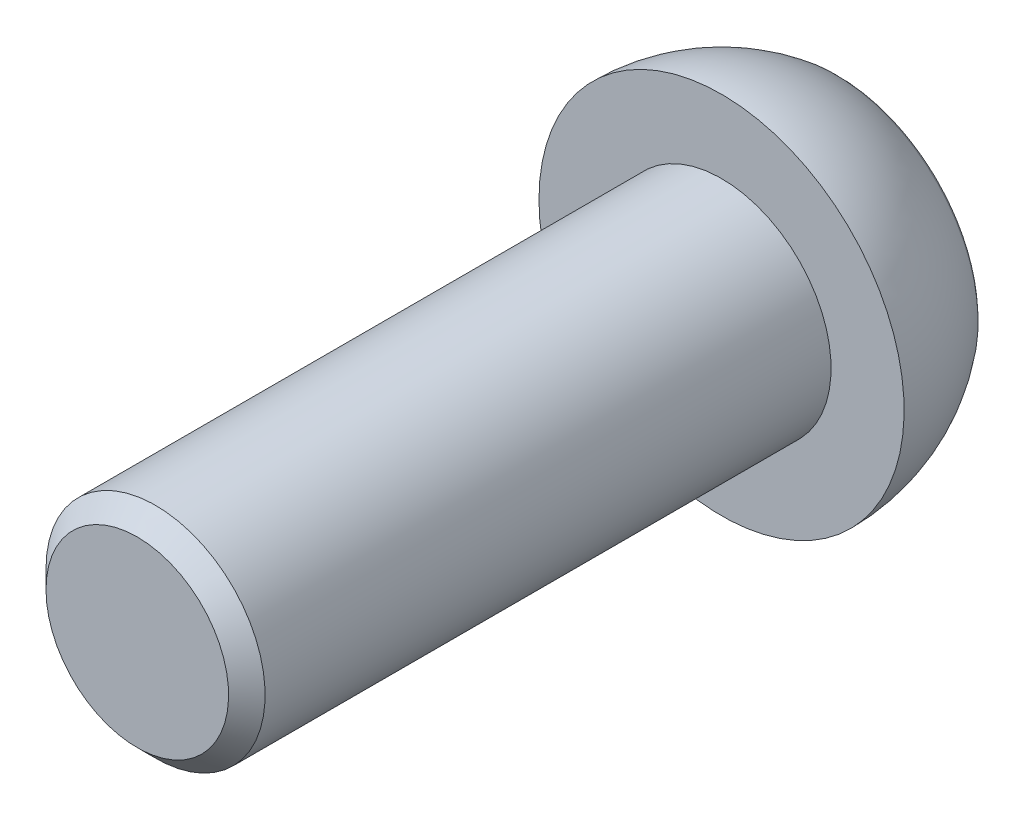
ISO-10303-21;
HEADER;
FILE_DESCRIPTION(('STEP AP214'),'2;1');
FILE_NAME('part.step','',(''),(''),'','','');
FILE_SCHEMA(('AUTOMOTIVE_DESIGN { 1 0 10303 214 1 1 1 1 }'));
ENDSEC;
DATA;
#1=APPLICATION_CONTEXT('core data for automotive mechanical design processes');
#2=APPLICATION_PROTOCOL_DEFINITION('international standard','automotive_design',2000,#1);
#3=PRODUCT_CONTEXT('',#1,'mechanical');
#4=PRODUCT('Part','Part','',(#3));
#5=PRODUCT_RELATED_PRODUCT_CATEGORY('part','',(#4));
#6=PRODUCT_DEFINITION_FORMATION('','',#4);
#7=PRODUCT_DEFINITION_CONTEXT('part definition',#1,'design');
#8=PRODUCT_DEFINITION('design','',#6,#7);
#9=PRODUCT_DEFINITION_SHAPE('','',#8);
#10=(LENGTH_UNIT() NAMED_UNIT(*) SI_UNIT(.MILLI.,.METRE.));
#11=(NAMED_UNIT(*) PLANE_ANGLE_UNIT() SI_UNIT($,.RADIAN.));
#12=(NAMED_UNIT(*) SI_UNIT($,.STERADIAN.) SOLID_ANGLE_UNIT());
#13=UNCERTAINTY_MEASURE_WITH_UNIT(LENGTH_MEASURE(1.E-05),#10,'distance_accuracy_value','');
#14=(GEOMETRIC_REPRESENTATION_CONTEXT(3) GLOBAL_UNCERTAINTY_ASSIGNED_CONTEXT((#13)) GLOBAL_UNIT_ASSIGNED_CONTEXT((#10,
#11,#12)) REPRESENTATION_CONTEXT('',''));
#15=CARTESIAN_POINT('',(0.,0.,0.));
#16=DIRECTION('',(0.,0.,1.));
#17=DIRECTION('',(1.,0.,0.));
#18=AXIS2_PLACEMENT_3D('',#15,#16,#17);
#19=CARTESIAN_POINT('',(-62.1361919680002,258.189999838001,-24.0000000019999));
#20=DIRECTION('',(0.,0.,-0.999999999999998));
#21=DIRECTION('',(0.99035023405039,0.138587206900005,0.));
#22=AXIS2_PLACEMENT_3D('',#19,#20,#21);
#23=PLANE('',#22);
#24=DIRECTION('',(0.3751550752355,0.926962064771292,0.));
#25=VECTOR('',#24,1.);
#26=CARTESIAN_POINT('',(-61.2958197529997,257.113059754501,-24.0000000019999));
#27=LINE('',#26,#25);
#28=CARTESIAN_POINT('',(-61.8082911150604,255.846806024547,-24.0000000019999));
#29=VERTEX_POINT('',#28);
#30=CARTESIAN_POINT('',(-60.7833483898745,258.379313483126,-24.0000000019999));
#31=VERTEX_POINT('',#30);
#32=EDGE_CURVE('E123',#29,#31,#27,.T.);
#33=ORIENTED_EDGE('',*,*,#32,.T.);
#34=DIRECTION('',(0.990350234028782,0.13858720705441,0.));
#35=VECTOR('',#34,1.);
#36=CARTESIAN_POINT('',(-59.4305048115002,258.568627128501,-24.0000000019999));
#37=LINE('',#36,#35);
#38=CARTESIAN_POINT('',(-58.0776612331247,258.757940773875,-24.0000000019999));
#39=VERTEX_POINT('',#38);
#40=EDGE_CURVE('E103',#31,#39,#37,.T.);
#41=ORIENTED_EDGE('',*,*,#40,.T.);
#42=DIRECTION('',(0.615195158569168,-0.788374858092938,0.));
#43=VECTOR('',#42,1.);
#44=CARTESIAN_POINT('',(-57.2372890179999,257.681000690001,-24.0000000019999));
#45=LINE('',#44,#43);
#46=CARTESIAN_POINT('',(-56.3969168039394,256.604060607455,-24.0000000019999));
#47=VERTEX_POINT('',#46);
#48=EDGE_CURVE('E99',#39,#47,#45,.T.);
#49=ORIENTED_EDGE('',*,*,#48,.T.);
#50=DIRECTION('',(-0.375155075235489,-0.926962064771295,0.));
#51=VECTOR('',#50,1.);
#52=CARTESIAN_POINT('',(-56.9093881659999,255.337806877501,-24.0000000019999));
#53=LINE('',#52,#51);
#54=CARTESIAN_POINT('',(-57.4218595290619,254.071553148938,-24.0000000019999));
#55=VERTEX_POINT('',#54);
#56=EDGE_CURVE('E101',#47,#55,#53,.T.);
#57=ORIENTED_EDGE('',*,*,#56,.T.);
#58=DIRECTION('',(-0.990350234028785,-0.13858720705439,0.));
#59=VECTOR('',#58,1.);
#60=CARTESIAN_POINT('',(-58.7747031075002,253.882239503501,-24.0000000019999));
#61=LINE('',#60,#59);
#62=CARTESIAN_POINT('',(-60.1275466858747,253.692925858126,-24.0000000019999));
#63=VERTEX_POINT('',#62);
#64=EDGE_CURVE('E85',#55,#63,#61,.T.);
#65=ORIENTED_EDGE('',*,*,#64,.T.);
#66=DIRECTION('',(-0.615195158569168,0.788374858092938,0.));
#67=VECTOR('',#66,1.);
#68=CARTESIAN_POINT('',(-60.9679189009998,254.769865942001,-24.0000000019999));
#69=LINE('',#68,#67);
#70=EDGE_CURVE('E130',#63,#29,#69,.T.);
#71=ORIENTED_EDGE('',*,*,#70,.T.);
#72=EDGE_LOOP('',(#33,#41,#49,#57,#65,#71));
#73=FACE_BOUND('',#72,.T.);
#74=ADVANCED_FACE('F30',(#73),#23,.T.);
#75=CARTESIAN_POINT('',(-59.1026039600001,256.225433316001,-8.000000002));
#76=DIRECTION('',(0.,0.,-0.999999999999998));
#77=DIRECTION('',(-1.,0.,0.));
#78=AXIS2_PLACEMENT_3D('',#75,#76,#77);
#79=CYLINDRICAL_SURFACE('',#78,3.00000000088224);
#80=CARTESIAN_POINT('',(-59.1026039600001,256.225433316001,-7.50000000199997));
#81=DIRECTION('',(0.,0.,-1.));
#82=DIRECTION('',(-1.,0.,0.));
#83=AXIS2_PLACEMENT_3D('',#80,#81,#82);
#84=CIRCLE('',#83,3.00000000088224);
#85=CARTESIAN_POINT('',(-62.1026039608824,256.225433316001,-7.50000000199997));
#86=VERTEX_POINT('',#85);
#87=EDGE_CURVE('E11',#86,#86,#84,.T.);
#88=CARTESIAN_POINT('',(-59.1026039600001,256.225433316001,-23.000000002));
#89=DIRECTION('',(0.,0.,-0.999999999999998));
#90=DIRECTION('',(-1.,0.,0.));
#91=AXIS2_PLACEMENT_3D('',#88,#89,#90);
#92=CIRCLE('',#91,3.00000000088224);
#93=CARTESIAN_POINT('',(-62.1026039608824,256.225433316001,-23.000000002));
#94=VERTEX_POINT('',#93);
#95=EDGE_CURVE('E144',#94,#94,#92,.F.);
#96=CARTESIAN_POINT('',(-62.1026039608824,256.225433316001,-7.50000000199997));
#97=CARTESIAN_POINT('',(-62.1026039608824,256.225433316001,-7.6614583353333));
#98=CARTESIAN_POINT('',(-62.1026039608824,256.225433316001,-7.82291666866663));
#99=CARTESIAN_POINT('',(-62.1026039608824,256.225433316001,-8.1458333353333));
#100=CARTESIAN_POINT('',(-62.1026039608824,256.225433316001,-8.30729166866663));
#101=CARTESIAN_POINT('',(-62.1026039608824,256.225433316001,-8.6302083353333));
#102=CARTESIAN_POINT('',(-62.1026039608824,256.225433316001,-8.79166666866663));
#103=CARTESIAN_POINT('',(-62.1026039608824,256.225433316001,-9.1145833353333));
#104=CARTESIAN_POINT('',(-62.1026039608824,256.225433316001,-9.27604166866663));
#105=CARTESIAN_POINT('',(-62.1026039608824,256.225433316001,-9.5989583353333));
#106=CARTESIAN_POINT('',(-62.1026039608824,256.225433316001,-9.76041666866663));
#107=CARTESIAN_POINT('',(-62.1026039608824,256.225433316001,-10.0833333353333));
#108=CARTESIAN_POINT('',(-62.1026039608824,256.225433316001,-10.2447916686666));
#109=CARTESIAN_POINT('',(-62.1026039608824,256.225433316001,-10.5677083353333));
#110=CARTESIAN_POINT('',(-62.1026039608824,256.225433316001,-10.7291666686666));
#111=CARTESIAN_POINT('',(-62.1026039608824,256.225433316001,-11.0520833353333));
#112=CARTESIAN_POINT('',(-62.1026039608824,256.225433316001,-11.2135416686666));
#113=CARTESIAN_POINT('',(-62.1026039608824,256.225433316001,-11.5364583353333));
#114=CARTESIAN_POINT('',(-62.1026039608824,256.225433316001,-11.6979166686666));
#115=CARTESIAN_POINT('',(-62.1026039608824,256.225433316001,-12.0208333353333));
#116=CARTESIAN_POINT('',(-62.1026039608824,256.225433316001,-12.1822916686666));
#117=CARTESIAN_POINT('',(-62.1026039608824,256.225433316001,-12.5052083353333));
#118=CARTESIAN_POINT('',(-62.1026039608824,256.225433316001,-12.6666666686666));
#119=CARTESIAN_POINT('',(-62.1026039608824,256.225433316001,-12.9895833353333));
#120=CARTESIAN_POINT('',(-62.1026039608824,256.225433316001,-13.1510416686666));
#121=CARTESIAN_POINT('',(-62.1026039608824,256.225433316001,-13.4739583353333));
#122=CARTESIAN_POINT('',(-62.1026039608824,256.225433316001,-13.6354166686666));
#123=CARTESIAN_POINT('',(-62.1026039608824,256.225433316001,-13.9583333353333));
#124=CARTESIAN_POINT('',(-62.1026039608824,256.225433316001,-14.1197916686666));
#125=CARTESIAN_POINT('',(-62.1026039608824,256.225433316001,-14.4427083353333));
#126=CARTESIAN_POINT('',(-62.1026039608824,256.225433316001,-14.6041666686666));
#127=CARTESIAN_POINT('',(-62.1026039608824,256.225433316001,-14.9270833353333));
#128=CARTESIAN_POINT('',(-62.1026039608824,256.225433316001,-15.0885416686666));
#129=CARTESIAN_POINT('',(-62.1026039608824,256.225433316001,-15.4114583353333));
#130=CARTESIAN_POINT('',(-62.1026039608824,256.225433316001,-15.5729166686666));
#131=CARTESIAN_POINT('',(-62.1026039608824,256.225433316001,-15.8958333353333));
#132=CARTESIAN_POINT('',(-62.1026039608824,256.225433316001,-16.0572916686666));
#133=CARTESIAN_POINT('',(-62.1026039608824,256.225433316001,-16.3802083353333));
#134=CARTESIAN_POINT('',(-62.1026039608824,256.225433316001,-16.5416666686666));
#135=CARTESIAN_POINT('',(-62.1026039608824,256.225433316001,-16.8645833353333));
#136=CARTESIAN_POINT('',(-62.1026039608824,256.225433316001,-17.0260416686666));
#137=CARTESIAN_POINT('',(-62.1026039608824,256.225433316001,-17.3489583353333));
#138=CARTESIAN_POINT('',(-62.1026039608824,256.225433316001,-17.5104166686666));
#139=CARTESIAN_POINT('',(-62.1026039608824,256.225433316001,-17.8333333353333));
#140=CARTESIAN_POINT('',(-62.1026039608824,256.225433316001,-17.9947916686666));
#141=CARTESIAN_POINT('',(-62.1026039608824,256.225433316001,-18.3177083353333));
#142=CARTESIAN_POINT('',(-62.1026039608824,256.225433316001,-18.4791666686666));
#143=CARTESIAN_POINT('',(-62.1026039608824,256.225433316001,-18.8020833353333));
#144=CARTESIAN_POINT('',(-62.1026039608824,256.225433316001,-18.9635416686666));
#145=CARTESIAN_POINT('',(-62.1026039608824,256.225433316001,-19.2864583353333));
#146=CARTESIAN_POINT('',(-62.1026039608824,256.225433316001,-19.4479166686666));
#147=CARTESIAN_POINT('',(-62.1026039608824,256.225433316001,-19.7708333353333));
#148=CARTESIAN_POINT('',(-62.1026039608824,256.225433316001,-19.9322916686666));
#149=CARTESIAN_POINT('',(-62.1026039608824,256.225433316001,-20.2552083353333));
#150=CARTESIAN_POINT('',(-62.1026039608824,256.225433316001,-20.4166666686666));
#151=CARTESIAN_POINT('',(-62.1026039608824,256.225433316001,-20.7395833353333));
#152=CARTESIAN_POINT('',(-62.1026039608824,256.225433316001,-20.9010416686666));
#153=CARTESIAN_POINT('',(-62.1026039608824,256.225433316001,-21.2239583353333));
#154=CARTESIAN_POINT('',(-62.1026039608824,256.225433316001,-21.3854166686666));
#155=CARTESIAN_POINT('',(-62.1026039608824,256.225433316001,-21.7083333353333));
#156=CARTESIAN_POINT('',(-62.1026039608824,256.225433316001,-21.8697916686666));
#157=CARTESIAN_POINT('',(-62.1026039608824,256.225433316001,-22.1927083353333));
#158=CARTESIAN_POINT('',(-62.1026039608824,256.225433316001,-22.3541666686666));
#159=CARTESIAN_POINT('',(-62.1026039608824,256.225433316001,-22.6770833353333));
#160=CARTESIAN_POINT('',(-62.1026039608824,256.225433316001,-22.8385416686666));
#161=CARTESIAN_POINT('',(-62.1026039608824,256.225433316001,-23.000000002));
#162=B_SPLINE_CURVE_WITH_KNOTS('',3,(#96,#97,#98,#99,#100,#101,#102,#103,#104,#105,#106,#107,
#108,#109,#110,#111,#112,#113,#114,#115,#116,#117,#118,#119,#120,#121,#122,#123,#124,#125,#126,
#127,#128,#129,#130,#131,#132,#133,#134,#135,#136,#137,#138,#139,#140,#141,#142,#143,#144,#145,
#146,#147,#148,#149,#150,#151,#152,#153,#154,#155,#156,#157,#158,#159,#160,#161),.UNSPECIFIED.,
.F.,.F.,(4,2,2,2,2,2,2,2,2,2,2,2,2,2,2,2,2,2,2,2,2,2,2,2,2,2,2,2,2,2,2,2,4),(0.,0.484375,
0.968749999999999,1.453125,1.9375,2.421875,2.90625,3.390625,3.875,4.359375,4.84375,5.328125,
5.81249999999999,6.29687499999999,6.78124999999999,7.26562499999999,7.74999999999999,
8.23437499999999,8.71874999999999,9.20312499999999,9.68749999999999,10.171875,10.65625,
11.140625,11.625,12.109375,12.59375,13.078125,13.5625,14.046875,14.53125,15.015625,15.5),.UNSPECIFIED.);
#163=EDGE_CURVE('BSEAM187',#86,#94,#162,.T.);
#164=ORIENTED_EDGE('',*,*,#87,.T.);
#165=ORIENTED_EDGE('',*,*,#95,.T.);
#166=ORIENTED_EDGE('',*,*,#163,.T.);
#167=ORIENTED_EDGE('',*,*,#163,.F.);
#168=EDGE_LOOP('',(#164,#166,#165,#167));
#169=FACE_BOUND('',#168,.T.);
#170=ADVANCED_FACE('F187',(#169),#79,.T.);
#171=CARTESIAN_POINT('',(-57.4218595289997,254.071553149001,-26.3000000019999));
#172=DIRECTION('',(0.926962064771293,-0.375155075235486,0.));
#173=DIRECTION('',(0.375155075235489,0.926962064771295,0.));
#174=AXIS2_PLACEMENT_3D('',#171,#172,#173);
#175=PLANE('',#174);
#176=DIRECTION('',(0.,0.,0.999999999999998));
#177=VECTOR('',#176,1.);
#178=CARTESIAN_POINT('',(-57.4218595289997,254.071553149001,-25.1500000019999));
#179=LINE('',#178,#177);
#180=CARTESIAN_POINT('',(-57.4218595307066,254.071553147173,-26.3000000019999));
#181=VERTEX_POINT('',#180);
#182=EDGE_CURVE('E111',#181,#55,#179,.T.);
#183=ORIENTED_EDGE('',*,*,#182,.T.);
#184=ORIENTED_EDGE('',*,*,#56,.F.);
#185=DIRECTION('',(0.,0.,-0.999999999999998));
#186=VECTOR('',#185,1.);
#187=CARTESIAN_POINT('',(-56.396916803,256.604060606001,-25.1500000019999));
#188=LINE('',#187,#186);
#189=CARTESIAN_POINT('',(-56.3969168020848,256.604060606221,-26.3000000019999));
#190=VERTEX_POINT('',#189);
#191=EDGE_CURVE('E107',#47,#190,#188,.T.);
#192=ORIENTED_EDGE('',*,*,#191,.T.);
#193=DIRECTION('',(0.37515507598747,0.926962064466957,0.));
#194=VECTOR('',#193,1.);
#195=CARTESIAN_POINT('',(-57.4218595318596,254.07155314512,-26.3000000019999));
#196=LINE('',#195,#194);
#197=EDGE_CURVE('E76',#181,#190,#196,.T.);
#198=ORIENTED_EDGE('',*,*,#197,.F.);
#199=EDGE_LOOP('',(#183,#184,#192,#198));
#200=FACE_BOUND('',#199,.T.);
#201=ADVANCED_FACE('F109',(#200),#175,.F.);
#202=CARTESIAN_POINT('',(-56.396916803,256.604060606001,-26.3000000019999));
#203=DIRECTION('',(0.788374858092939,0.615195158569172,0.));
#204=DIRECTION('',(-0.615195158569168,0.788374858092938,0.));
#205=AXIS2_PLACEMENT_3D('',#202,#203,#204);
#206=PLANE('',#205);
#207=ORIENTED_EDGE('',*,*,#191,.F.);
#208=ORIENTED_EDGE('',*,*,#48,.F.);
#209=DIRECTION('',(0.,0.,-0.999999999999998));
#210=VECTOR('',#209,1.);
#211=CARTESIAN_POINT('',(-58.0776612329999,258.757940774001,-25.1500000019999));
#212=LINE('',#211,#210);
#213=CARTESIAN_POINT('',(-58.077661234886,258.757940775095,-26.3000000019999));
#214=VERTEX_POINT('',#213);
#215=EDGE_CURVE('E117',#39,#214,#212,.T.);
#216=ORIENTED_EDGE('',*,*,#215,.T.);
#217=DIRECTION('',(-0.615195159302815,0.788374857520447,0.));
#218=VECTOR('',#217,1.);
#219=CARTESIAN_POINT('',(-56.3969168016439,256.604060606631,-26.3000000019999));
#220=LINE('',#219,#218);
#221=EDGE_CURVE('E115',#190,#214,#220,.T.);
#222=ORIENTED_EDGE('',*,*,#221,.F.);
#223=EDGE_LOOP('',(#207,#208,#216,#222));
#224=FACE_BOUND('',#223,.T.);
#225=ADVANCED_FACE('F113',(#224),#206,.F.);
#226=CARTESIAN_POINT('',(-58.0776612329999,258.757940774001,-24.0000000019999));
#227=DIRECTION('',(-0.138587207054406,0.990350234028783,0.));
#228=DIRECTION('',(0.,0.,-0.999999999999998));
#229=AXIS2_PLACEMENT_3D('',#226,#227,#228);
#230=PLANE('',#229);
#231=ORIENTED_EDGE('',*,*,#215,.F.);
#232=ORIENTED_EDGE('',*,*,#40,.F.);
#233=DIRECTION('',(0.,0.,-0.999999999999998));
#234=VECTOR('',#233,1.);
#235=CARTESIAN_POINT('',(-60.7833483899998,258.379313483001,-25.1500000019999));
#236=LINE('',#235,#234);
#237=CARTESIAN_POINT('',(-60.7833483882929,258.379313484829,-26.3000000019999));
#238=VERTEX_POINT('',#237);
#239=EDGE_CURVE('E128',#31,#238,#236,.T.);
#240=ORIENTED_EDGE('',*,*,#239,.T.);
#241=DIRECTION('',(-0.990350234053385,-0.138587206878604,0.));
#242=VECTOR('',#241,1.);
#243=CARTESIAN_POINT('',(-59.4305048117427,258.568627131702,-26.3000000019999));
#244=LINE('',#243,#242);
#245=EDGE_CURVE('E124',#214,#238,#244,.T.);
#246=ORIENTED_EDGE('',*,*,#245,.F.);
#247=EDGE_LOOP('',(#231,#232,#240,#246));
#248=FACE_BOUND('',#247,.T.);
#249=ADVANCED_FACE('F214',(#248),#230,.F.);
#250=CARTESIAN_POINT('',(-60.7833483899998,258.379313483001,-26.3000000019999));
#251=DIRECTION('',(-0.926962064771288,0.375155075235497,0.));
#252=DIRECTION('',(-0.3751550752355,-0.926962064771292,0.));
#253=AXIS2_PLACEMENT_3D('',#250,#251,#252);
#254=PLANE('',#253);
#255=ORIENTED_EDGE('',*,*,#239,.F.);
#256=ORIENTED_EDGE('',*,*,#32,.F.);
#257=DIRECTION('',(0.,0.,-0.999999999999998));
#258=VECTOR('',#257,1.);
#259=CARTESIAN_POINT('',(-61.8082911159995,255.846806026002,-25.1500000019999));
#260=LINE('',#259,#258);
#261=CARTESIAN_POINT('',(-61.8082911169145,255.846806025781,-26.3000000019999));
#262=VERTEX_POINT('',#261);
#263=EDGE_CURVE('E208',#29,#262,#260,.T.);
#264=ORIENTED_EDGE('',*,*,#263,.T.);
#265=DIRECTION('',(-0.375155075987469,-0.926962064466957,0.));
#266=VECTOR('',#265,1.);
#267=CARTESIAN_POINT('',(-60.7833483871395,258.379313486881,-26.3000000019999));
#268=LINE('',#267,#266);
#269=EDGE_CURVE('E127',#238,#262,#268,.T.);
#270=ORIENTED_EDGE('',*,*,#269,.F.);
#271=EDGE_LOOP('',(#255,#256,#264,#270));
#272=FACE_BOUND('',#271,.T.);
#273=ADVANCED_FACE('F217',(#272),#254,.F.);
#274=CARTESIAN_POINT('',(-61.8082911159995,255.846806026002,-26.3000000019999));
#275=DIRECTION('',(-0.788374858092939,-0.615195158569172,0.));
#276=DIRECTION('',(0.615195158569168,-0.788374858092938,0.));
#277=AXIS2_PLACEMENT_3D('',#274,#275,#276);
#278=PLANE('',#277);
#279=ORIENTED_EDGE('',*,*,#263,.F.);
#280=ORIENTED_EDGE('',*,*,#70,.F.);
#281=DIRECTION('',(0.,0.,-0.999999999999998));
#282=VECTOR('',#281,1.);
#283=CARTESIAN_POINT('',(-60.1275466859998,253.692925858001,-25.1500000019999));
#284=LINE('',#283,#282);
#285=CARTESIAN_POINT('',(-60.1275466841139,253.692925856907,-26.3000000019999));
#286=VERTEX_POINT('',#285);
#287=EDGE_CURVE('E206',#63,#286,#284,.T.);
#288=ORIENTED_EDGE('',*,*,#287,.T.);
#289=DIRECTION('',(0.615195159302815,-0.788374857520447,0.));
#290=VECTOR('',#289,1.);
#291=CARTESIAN_POINT('',(-61.8082911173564,255.84680602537,-26.3000000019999));
#292=LINE('',#291,#290);
#293=EDGE_CURVE('E135',#262,#286,#292,.T.);
#294=ORIENTED_EDGE('',*,*,#293,.F.);
#295=EDGE_LOOP('',(#279,#280,#288,#294));
#296=FACE_BOUND('',#295,.T.);
#297=ADVANCED_FACE('F289',(#296),#278,.F.);
#298=CARTESIAN_POINT('',(-57.4218595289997,254.071553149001,-26.3000000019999));
#299=DIRECTION('',(0.138587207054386,-0.990350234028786,0.));
#300=DIRECTION('',(0.,0.,0.999999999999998));
#301=AXIS2_PLACEMENT_3D('',#298,#299,#300);
#302=PLANE('',#301);
#303=ORIENTED_EDGE('',*,*,#287,.F.);
#304=ORIENTED_EDGE('',*,*,#64,.F.);
#305=ORIENTED_EDGE('',*,*,#182,.F.);
#306=DIRECTION('',(0.990350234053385,0.138587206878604,0.));
#307=VECTOR('',#306,1.);
#308=CARTESIAN_POINT('',(-58.7747031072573,253.8822395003,-26.3000000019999));
#309=LINE('',#308,#307);
#310=EDGE_CURVE('E138',#286,#181,#309,.T.);
#311=ORIENTED_EDGE('',*,*,#310,.F.);
#312=EDGE_LOOP('',(#303,#304,#305,#311));
#313=FACE_BOUND('',#312,.T.);
#314=ADVANCED_FACE('F186',(#313),#302,.F.);
#315=CARTESIAN_POINT('',(-59.5908166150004,259.714222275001,-26.300000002));
#316=CARTESIAN_POINT('',(-52.6132386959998,260.690647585,-26.300000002));
#317=CARTESIAN_POINT('',(-51.6368133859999,253.713069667,-26.300000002));
#318=CARTESIAN_POINT('',(-58.614391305,252.736644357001,-26.3000000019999));
#319=CARTESIAN_POINT('',(-59.612318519,259.867875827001,-26.3000000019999));
#320=CARTESIAN_POINT('',(-52.3274334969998,260.887304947,-26.3000000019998));
#321=CARTESIAN_POINT('',(-51.3080043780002,253.602419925,-26.3000000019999));
#322=CARTESIAN_POINT('',(-58.5928894,252.582990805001,-26.3000000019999));
#323=CARTESIAN_POINT('',(-59.6316835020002,260.006258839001,-26.2325694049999));
#324=CARTESIAN_POINT('',(-52.0700324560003,261.064417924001,-26.2325694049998));
#325=CARTESIAN_POINT('',(-51.0118733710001,253.502766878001,-26.2325694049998));
#326=CARTESIAN_POINT('',(-58.5735244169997,252.444607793,-26.2325694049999));
#327=CARTESIAN_POINT('',(-59.645062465,260.101865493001,-26.111111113));
#328=CARTESIAN_POINT('',(-51.8921981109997,261.186782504,-26.111111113));
#329=CARTESIAN_POINT('',(-50.8072811,253.433918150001,-26.111111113));
#330=CARTESIAN_POINT('',(-58.5601454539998,252.349001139,-26.1111111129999));
#331=(BOUNDED_SURFACE() B_SPLINE_SURFACE(3,3,((#315,#316,#317,#318),(#319,#320,#321,#322),(#323,
#324,#325,#326),(#327,#328,#329,#330)),.UNSPECIFIED.,.F.,.F.,
.F.) B_SPLINE_SURFACE_WITH_KNOTS((4,4),(4,4),(0.,1.),(0.,1.),
.UNSPECIFIED.) GEOMETRIC_REPRESENTATION_ITEM() RATIONAL_B_SPLINE_SURFACE(((1.,0.333333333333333,
0.333333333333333,1.),(0.933744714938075,0.311248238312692,0.311248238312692,0.933744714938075),
(0.933744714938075,0.311248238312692,0.311248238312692,0.933744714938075),(1.,0.333333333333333,
0.333333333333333,1.))) REPRESENTATION_ITEM('') SURFACE());
#332=CARTESIAN_POINT('',(-58.614391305,252.736644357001,-26.3000000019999));
#333=CARTESIAN_POINT('',(-58.5928894,252.582990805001,-26.3000000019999));
#334=CARTESIAN_POINT('',(-58.5735244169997,252.444607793,-26.2325694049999));
#335=CARTESIAN_POINT('',(-58.5601454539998,252.349001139,-26.1111111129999));
#336=(BOUNDED_CURVE() B_SPLINE_CURVE(3,(#332,#333,#334,#335),.UNSPECIFIED.,.F.,
.F.) B_SPLINE_CURVE_WITH_KNOTS((4,4),(0.,1.),
.UNSPECIFIED.) CURVE() GEOMETRIC_REPRESENTATION_ITEM() RATIONAL_B_SPLINE_CURVE((1.,
0.933744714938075,0.933744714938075,1.)) REPRESENTATION_ITEM(''));
#337=CARTESIAN_POINT('',(-58.5601454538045,252.349001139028,-26.1111111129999));
#338=VERTEX_POINT('',#337);
#339=CARTESIAN_POINT('',(-58.614391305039,252.736644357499,-26.3000000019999));
#340=VERTEX_POINT('',#339);
#341=EDGE_CURVE('E146',#338,#340,#336,.F.);
#342=CARTESIAN_POINT('',(-58.614391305,252.736644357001,-26.3000000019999));
#343=CARTESIAN_POINT('',(-51.6368133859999,253.713069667,-26.300000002));
#344=CARTESIAN_POINT('',(-52.6132386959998,260.690647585,-26.300000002));
#345=CARTESIAN_POINT('',(-59.5908166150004,259.714222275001,-26.300000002));
#346=(BOUNDED_CURVE() B_SPLINE_CURVE(3,(#342,#343,#344,#345),.UNSPECIFIED.,.F.,
.F.) B_SPLINE_CURVE_WITH_KNOTS((4,4),(0.,1.),
.UNSPECIFIED.) CURVE() GEOMETRIC_REPRESENTATION_ITEM() RATIONAL_B_SPLINE_CURVE((1.,
0.333333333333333,0.333333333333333,1.)) REPRESENTATION_ITEM(''));
#347=CARTESIAN_POINT('',(-59.5908166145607,259.714222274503,-26.300000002));
#348=VERTEX_POINT('',#347);
#349=EDGE_CURVE('E143',#348,#340,#346,.F.);
#350=CARTESIAN_POINT('',(-59.5908166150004,259.714222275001,-26.300000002));
#351=CARTESIAN_POINT('',(-59.612318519,259.867875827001,-26.3000000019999));
#352=CARTESIAN_POINT('',(-59.6316835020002,260.006258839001,-26.2325694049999));
#353=CARTESIAN_POINT('',(-59.645062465,260.101865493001,-26.111111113));
#354=(BOUNDED_CURVE() B_SPLINE_CURVE(3,(#350,#351,#352,#353),.UNSPECIFIED.,.F.,
.F.) B_SPLINE_CURVE_WITH_KNOTS((4,4),(0.,1.),
.UNSPECIFIED.) CURVE() GEOMETRIC_REPRESENTATION_ITEM() RATIONAL_B_SPLINE_CURVE((1.,
0.933744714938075,0.933744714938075,1.)) REPRESENTATION_ITEM(''));
#355=CARTESIAN_POINT('',(-59.6450624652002,260.101865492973,-26.111111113));
#356=VERTEX_POINT('',#355);
#357=EDGE_CURVE('E229',#348,#356,#354,.T.);
#358=CARTESIAN_POINT('',(-59.1026039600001,256.225433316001,-26.1111110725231));
#359=DIRECTION('',(0.,0.,-0.999999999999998));
#360=DIRECTION('',(-0.990350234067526,-0.138587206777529,0.));
#361=AXIS2_PLACEMENT_3D('',#358,#359,#360);
#362=CIRCLE('',#361,3.91420335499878);
#363=EDGE_CURVE('E134',#356,#338,#362,.T.);
#364=ORIENTED_EDGE('',*,*,#341,.T.);
#365=ORIENTED_EDGE('',*,*,#349,.F.);
#366=ORIENTED_EDGE('',*,*,#357,.T.);
#367=ORIENTED_EDGE('',*,*,#363,.T.);
#368=EDGE_LOOP('',(#364,#365,#366,#367));
#369=FACE_BOUND('',#368,.T.);
#370=ADVANCED_FACE('F173',(#369),#331,.T.);
#371=CARTESIAN_POINT('',(-64.8150274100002,260.535354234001,-23.000000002));
#372=DIRECTION('',(0.,0.,-0.999999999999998));
#373=DIRECTION('',(0.9903502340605,0.138587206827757,0.));
#374=AXIS2_PLACEMENT_3D('',#371,#372,#373);
#375=PLANE('',#374);
#376=ORIENTED_EDGE('',*,*,#95,.F.);
#377=EDGE_LOOP('',(#376));
#378=FACE_BOUND('',#377,.T.);
#379=CARTESIAN_POINT('',(-59.1026039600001,256.225433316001,-23.000000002));
#380=DIRECTION('',(0.,0.,-0.999999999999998));
#381=DIRECTION('',(-1.,0.,0.));
#382=AXIS2_PLACEMENT_3D('',#379,#380,#381);
#383=CIRCLE('',#382,4.99999999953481);
#384=CARTESIAN_POINT('',(-64.1026039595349,256.225433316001,-23.000000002));
#385=VERTEX_POINT('',#384);
#386=EDGE_CURVE('E131',#385,#385,#383,.F.);
#387=ORIENTED_EDGE('',*,*,#386,.T.);
#388=EDGE_LOOP('',(#387));
#389=FACE_BOUND('',#388,.T.);
#390=ADVANCED_FACE('F185',(#378,#389),#375,.F.);
#391=CARTESIAN_POINT('',(-56.0660207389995,260.250158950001,-26.300000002));
#392=DIRECTION('',(0.,0.,-0.999999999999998));
#393=DIRECTION('',(0.13858720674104,-0.990350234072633,0.));
#394=AXIS2_PLACEMENT_3D('',#391,#392,#393);
#395=PLANE('',#394);
#396=ORIENTED_EDGE('',*,*,#293,.T.);
#397=ORIENTED_EDGE('',*,*,#310,.T.);
#398=ORIENTED_EDGE('',*,*,#197,.T.);
#399=ORIENTED_EDGE('',*,*,#221,.T.);
#400=ORIENTED_EDGE('',*,*,#245,.T.);
#401=ORIENTED_EDGE('',*,*,#269,.T.);
#402=EDGE_LOOP('',(#396,#397,#398,#399,#400,#401));
#403=FACE_BOUND('',#402,.T.);
#404=CARTESIAN_POINT('',(-59.5908166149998,259.714222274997,-26.300000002));
#405=CARTESIAN_POINT('',(-59.6277319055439,259.709056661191,-26.300000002));
#406=CARTESIAN_POINT('',(-59.6645651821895,259.703304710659,-26.300000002));
#407=CARTESIAN_POINT('',(-59.739195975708,259.690433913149,-26.300000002));
#408=CARTESIAN_POINT('',(-59.7769870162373,259.683277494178,-26.300000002));
#409=CARTESIAN_POINT('',(-59.853507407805,259.667484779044,-26.300000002));
#410=CARTESIAN_POINT('',(-59.8922285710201,259.658808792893,-26.300000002));
#411=CARTESIAN_POINT('',(-59.9705737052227,259.639859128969,-26.300000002));
#412=CARTESIAN_POINT('',(-60.0101875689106,259.62954364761,-26.300000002));
#413=CARTESIAN_POINT('',(-60.0902717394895,259.607192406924,-26.300000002));
#414=CARTESIAN_POINT('',(-60.1307297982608,259.595112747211,-26.300000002));
#415=CARTESIAN_POINT('',(-60.2124438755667,259.569106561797,-26.300000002));
#416=CARTESIAN_POINT('',(-60.2536852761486,259.555134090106,-26.300000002));
#417=CARTESIAN_POINT('',(-60.3368941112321,259.525212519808,-26.300000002));
#418=CARTESIAN_POINT('',(-60.3788443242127,259.509215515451,-26.300000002));
#419=CARTESIAN_POINT('',(-60.4633840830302,259.475113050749,-26.300000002));
#420=CARTESIAN_POINT('',(-60.5059535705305,259.456957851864,-26.300000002));
#421=CARTESIAN_POINT('',(-60.5916290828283,259.418406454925,-26.300000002));
#422=CARTESIAN_POINT('',(-60.6347119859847,259.397958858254,-26.300000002));
#423=CARTESIAN_POINT('',(-60.7212941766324,259.354691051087,-26.300000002));
#424=CARTESIAN_POINT('',(-60.7647670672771,259.331818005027,-26.300000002));
#425=CARTESIAN_POINT('',(-60.851990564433,259.283570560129,-26.300000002));
#426=CARTESIAN_POINT('',(-60.8957113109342,259.2581421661,-26.300000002));
#427=CARTESIAN_POINT('',(-60.9832723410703,259.204660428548,-26.300000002));
#428=CARTESIAN_POINT('',(-61.0270791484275,259.176552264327,-26.300000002));
#429=CARTESIAN_POINT('',(-61.1146338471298,259.117595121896,-26.300000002));
#430=CARTESIAN_POINT('',(-61.158344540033,259.086690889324,-26.300000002));
#431=CARTESIAN_POINT('',(-61.2455078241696,259.022036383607,-26.300000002));
#432=CARTESIAN_POINT('',(-61.2889194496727,258.98823087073,-26.300000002));
#433=CARTESIAN_POINT('',(-61.3752646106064,258.917682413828,-26.300000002));
#434=CARTESIAN_POINT('',(-61.4181534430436,258.880884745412,-26.300000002));
#435=CARTESIAN_POINT('',(-61.503212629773,258.804277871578,-26.300000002));
#436=CARTESIAN_POINT('',(-61.5453346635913,258.764415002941,-26.300000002));
#437=CARTESIAN_POINT('',(-61.6286004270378,258.681624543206,-26.300000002));
#438=CARTESIAN_POINT('',(-61.6696924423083,258.638644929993,-26.300000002));
#439=CARTESIAN_POINT('',(-61.7506205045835,258.549592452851,-26.300000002));
#440=CARTESIAN_POINT('',(-61.7904017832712,258.503469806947,-26.300000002));
#441=CARTESIAN_POINT('',(-61.8684151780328,258.408131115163,-26.300000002));
#442=CARTESIAN_POINT('',(-61.9065899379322,258.358868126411,-26.300000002));
#443=CARTESIAN_POINT('',(-61.981084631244,258.257280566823,-26.300000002));
#444=CARTESIAN_POINT('',(-62.0173452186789,258.204912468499,-26.300000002));
#445=CARTESIAN_POINT('',(-62.087697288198,258.097181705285,-26.300000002));
#446=CARTESIAN_POINT('',(-62.12172816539,258.041779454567,-26.300000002));
#447=CARTESIAN_POINT('',(-62.1873024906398,257.928085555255,-26.300000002));
#448=CARTESIAN_POINT('',(-62.2187849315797,257.869758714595,-26.300000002));
#449=CARTESIAN_POINT('',(-62.2789455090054,257.750360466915,-26.300000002));
#450=CARTESIAN_POINT('',(-62.3075632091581,257.689258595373,-26.300000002));
#451=CARTESIAN_POINT('',(-62.3616842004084,257.564498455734,-26.300000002));
#452=CARTESIAN_POINT('',(-62.3871286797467,257.500814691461,-26.300000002));
#453=CARTESIAN_POINT('',(-62.4346087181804,257.371113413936,-26.300000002));
#454=CARTESIAN_POINT('',(-62.4565882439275,257.305075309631,-26.300000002));
#455=CARTESIAN_POINT('',(-62.4866944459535,257.204803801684,-26.300000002));
#456=CARTESIAN_POINT('',(-62.4962933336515,257.171005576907,-26.300000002));
#457=CARTESIAN_POINT('',(-62.5145317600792,257.102928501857,-26.300000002));
#458=CARTESIAN_POINT('',(-62.5231650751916,257.068647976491,-26.300000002));
#459=CARTESIAN_POINT('',(-62.539442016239,256.99964767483,-26.300000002));
#460=CARTESIAN_POINT('',(-62.5470797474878,256.964926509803,-26.300000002));
#461=CARTESIAN_POINT('',(-62.5613380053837,256.895086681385,-26.300000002));
#462=CARTESIAN_POINT('',(-62.5679530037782,256.859966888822,-26.300000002));
#463=CARTESIAN_POINT('',(-62.5801404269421,256.789374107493,-26.300000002));
#464=CARTESIAN_POINT('',(-62.5857077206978,256.753900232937,-26.300000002));
#465=CARTESIAN_POINT('',(-62.5957769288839,256.682645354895,-26.300000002));
#466=CARTESIAN_POINT('',(-62.6002741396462,256.646863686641,-26.300000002));
#467=CARTESIAN_POINT('',(-62.608183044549,256.575041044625,-26.300000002));
#468=CARTESIAN_POINT('',(-62.6115904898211,256.538999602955,-26.300000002));
#469=CARTESIAN_POINT('',(-62.6173025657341,256.466706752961,-26.300000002));
#470=CARTESIAN_POINT('',(-62.6196034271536,256.430455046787,-26.300000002));
#471=CARTESIAN_POINT('',(-62.6230880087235,256.357792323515,-26.300000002));
#472=CARTESIAN_POINT('',(-62.6242684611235,256.321381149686,-26.300000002));
#473=CARTESIAN_POINT('',(-62.625500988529,256.248451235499,-26.300000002));
#474=CARTESIAN_POINT('',(-62.6255503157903,256.211932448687,-26.300000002));
#475=CARTESIAN_POINT('',(-62.6245125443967,256.138839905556,-26.300000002));
#476=CARTESIAN_POINT('',(-62.6234232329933,256.102266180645,-26.300000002));
#477=CARTESIAN_POINT('',(-62.6201033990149,256.029116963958,-26.300000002));
#478=CARTESIAN_POINT('',(-62.6178712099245,255.992541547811,-26.300000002));
#479=CARTESIAN_POINT('',(-62.6122641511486,255.919442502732,-26.300000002));
#480=CARTESIAN_POINT('',(-62.6088881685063,255.882918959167,-26.300000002));
#481=CARTESIAN_POINT('',(-62.6009953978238,255.809977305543,-26.300000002));
#482=CARTESIAN_POINT('',(-62.5964780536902,255.773559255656,-26.300000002));
#483=CARTESIAN_POINT('',(-62.5863077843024,255.700882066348,-26.300000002));
#484=CARTESIAN_POINT('',(-62.5806548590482,255.664622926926,-26.300000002));
#485=CARTESIAN_POINT('',(-62.5682219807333,255.592316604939,-26.300000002));
#486=CARTESIAN_POINT('',(-62.5614425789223,255.556269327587,-26.300000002));
#487=CARTESIAN_POINT('',(-62.5467685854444,255.484439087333,-26.300000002));
#488=CARTESIAN_POINT('',(-62.5388750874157,255.448655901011,-26.300000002));
#489=CARTESIAN_POINT('',(-62.5219879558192,255.377405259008,-26.300000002));
#490=CARTESIAN_POINT('',(-62.512995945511,255.34193741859,-26.300000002));
#491=CARTESIAN_POINT('',(-62.4939299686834,255.27136769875,-26.300000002));
#492=CARTESIAN_POINT('',(-62.4838581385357,255.236265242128,-26.300000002));
#493=CARTESIAN_POINT('',(-62.4626537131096,255.166475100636,-26.300000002));
#494=CARTESIAN_POINT('',(-62.451523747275,255.131786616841,-26.300000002));
#495=CARTESIAN_POINT('',(-62.4282271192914,255.062871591,-26.300000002));
#496=CARTESIAN_POINT('',(-62.4160635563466,255.028644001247,-26.300000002));
#497=CARTESIAN_POINT('',(-62.3907265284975,254.960696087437,-26.300000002));
#498=CARTESIAN_POINT('',(-62.3775566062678,254.926974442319,-26.300000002));
#499=CARTESIAN_POINT('',(-62.3502362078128,254.860081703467,-26.300000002));
#500=CARTESIAN_POINT('',(-62.3360896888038,254.826908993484,-26.300000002));
#501=CARTESIAN_POINT('',(-62.3068478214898,254.761155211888,-26.300000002));
#502=CARTESIAN_POINT('',(-62.2917568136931,254.728572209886,-26.300000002));
#503=CARTESIAN_POINT('',(-62.2606598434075,254.664036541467,-26.300000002));
#504=CARTESIAN_POINT('',(-62.2446585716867,254.632081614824,-26.300000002));
#505=CARTESIAN_POINT('',(-62.2117769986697,254.568838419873,-26.300000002));
#506=CARTESIAN_POINT('',(-62.1949017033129,254.537547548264,-26.300000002));
#507=CARTESIAN_POINT('',(-62.1603094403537,254.475665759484,-26.300000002));
#508=CARTESIAN_POINT('',(-62.1425977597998,254.445071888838,-26.300000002));
#509=CARTESIAN_POINT('',(-62.1063727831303,254.384616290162,-26.300000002));
#510=CARTESIAN_POINT('',(-62.0878650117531,254.354751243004,-26.300000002));
#511=CARTESIAN_POINT('',(-62.031390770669,254.26659559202,-26.300000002));
#512=CARTESIAN_POINT('',(-61.9921280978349,254.209127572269,-26.300000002));
#513=CARTESIAN_POINT('',(-61.9108689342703,254.097441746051,-26.300000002));
#514=CARTESIAN_POINT('',(-61.8689206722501,254.043188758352,-26.300000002));
#515=CARTESIAN_POINT('',(-61.782631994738,253.938077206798,-26.300000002));
#516=CARTESIAN_POINT('',(-61.7383411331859,253.887177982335,-26.300000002));
#517=CARTESIAN_POINT('',(-61.6477167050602,253.788880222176,-26.300000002));
#518=CARTESIAN_POINT('',(-61.6014328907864,253.74143580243,-26.300000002));
#519=CARTESIAN_POINT('',(-61.5071685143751,253.650109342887,-26.300000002));
#520=CARTESIAN_POINT('',(-61.4592369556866,253.606176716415,-26.300000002));
#521=CARTESIAN_POINT('',(-61.3620152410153,253.521895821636,-26.300000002));
#522=CARTESIAN_POINT('',(-61.3127724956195,253.481492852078,-26.300000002));
#523=CARTESIAN_POINT('',(-61.2132535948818,253.40425633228,-26.300000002));
#524=CARTESIAN_POINT('',(-61.163022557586,253.367364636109,-26.300000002));
#525=CARTESIAN_POINT('',(-61.0618354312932,253.297102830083,-26.300000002));
#526=CARTESIAN_POINT('',(-61.0109216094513,253.26367183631,-26.300000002));
#527=CARTESIAN_POINT('',(-60.9086573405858,253.200254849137,-26.300000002));
#528=CARTESIAN_POINT('',(-60.8573458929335,253.170205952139,-26.300000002));
#529=CARTESIAN_POINT('',(-60.7545526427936,253.113452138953,-26.300000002));
#530=CARTESIAN_POINT('',(-60.7031062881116,253.086683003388,-26.300000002));
#531=CARTESIAN_POINT('',(-60.6002858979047,253.036367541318,-26.300000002));
#532=CARTESIAN_POINT('',(-60.5489435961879,253.012756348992,-26.300000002));
#533=CARTESIAN_POINT('',(-60.4465496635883,252.968619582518,-26.300000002));
#534=CARTESIAN_POINT('',(-60.3955259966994,252.948029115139,-26.300000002));
#535=CARTESIAN_POINT('',(-60.2939632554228,252.909784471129,-26.300000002));
#536=CARTESIAN_POINT('',(-60.2434484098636,252.892065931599,-26.300000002));
#537=CARTESIAN_POINT('',(-60.1430732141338,252.859407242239,-26.300000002));
#538=CARTESIAN_POINT('',(-60.0932334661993,252.844403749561,-26.300000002));
#539=CARTESIAN_POINT('',(-59.9943551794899,252.817011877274,-26.300000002));
#540=CARTESIAN_POINT('',(-59.9453337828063,252.804561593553,-26.300000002));
#541=CARTESIAN_POINT('',(-59.8482168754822,252.782110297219,-26.300000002));
#542=CARTESIAN_POINT('',(-59.8001352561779,252.772049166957,-26.300000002));
#543=CARTESIAN_POINT('',(-59.7050019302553,252.754210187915,-26.300000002));
#544=CARTESIAN_POINT('',(-59.6579611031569,252.746374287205,-26.300000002));
#545=CARTESIAN_POINT('',(-59.5649942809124,252.73282166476,-26.300000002));
#546=CARTESIAN_POINT('',(-59.5190764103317,252.727049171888,-26.300000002));
#547=CARTESIAN_POINT('',(-59.4284229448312,252.717462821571,-26.300000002));
#548=CARTESIAN_POINT('',(-59.3836929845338,252.713595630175,-26.3000000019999));
#549=CARTESIAN_POINT('',(-59.2954669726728,252.707664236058,-26.3000000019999));
#550=CARTESIAN_POINT('',(-59.2519743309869,252.70554924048,-26.3000000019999));
#551=CARTESIAN_POINT('',(-59.1662604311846,252.702972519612,-26.3000000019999));
#552=CARTESIAN_POINT('',(-59.1240406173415,252.702462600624,-26.3000000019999));
#553=CARTESIAN_POINT('',(-59.0408972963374,252.70295301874,-26.3000000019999));
#554=CARTESIAN_POINT('',(-58.9999735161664,252.703907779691,-26.3000000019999));
#555=CARTESIAN_POINT('',(-58.9194361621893,252.707191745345,-26.3000000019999));
#556=CARTESIAN_POINT('',(-58.879820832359,252.709477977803,-26.3000000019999));
#557=CARTESIAN_POINT('',(-58.8019047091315,252.715296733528,-26.3000000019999));
#558=CARTESIAN_POINT('',(-58.7636008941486,252.718788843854,-26.3000000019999));
#559=CARTESIAN_POINT('',(-58.6883038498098,252.726898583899,-26.3000000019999));
#560=CARTESIAN_POINT('',(-58.6513065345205,252.731478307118,-26.3000000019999));
#561=CARTESIAN_POINT('',(-58.6143913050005,252.736644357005,-26.3000000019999));
#562=B_SPLINE_CURVE_WITH_KNOTS('',3,(#404,#405,#406,#407,#408,#409,#410,#411,#412,#413,#414,
#415,#416,#417,#418,#419,#420,#421,#422,#423,#424,#425,#426,#427,#428,#429,#430,#431,#432,#433,
#434,#435,#436,#437,#438,#439,#440,#441,#442,#443,#444,#445,#446,#447,#448,#449,#450,#451,#452,
#453,#454,#455,#456,#457,#458,#459,#460,#461,#462,#463,#464,#465,#466,#467,#468,#469,#470,#471,
#472,#473,#474,#475,#476,#477,#478,#479,#480,#481,#482,#483,#484,#485,#486,#487,#488,#489,#490,
#491,#492,#493,#494,#495,#496,#497,#498,#499,#500,#501,#502,#503,#504,#505,#506,#507,#508,#509,
#510,#511,#512,#513,#514,#515,#516,#517,#518,#519,#520,#521,#522,#523,#524,#525,#526,#527,#528,
#529,#530,#531,#532,#533,#534,#535,#536,#537,#538,#539,#540,#541,#542,#543,#544,#545,#546,#547,
#548,#549,#550,#551,#552,#553,#554,#555,#556,#557,#558,#559,#560,#561),.UNSPECIFIED.,.F.,.F.,(4,
2,2,2,2,2,2,2,2,2,2,2,2,2,2,2,2,2,2,2,2,2,2,2,2,2,2,2,2,2,2,2,2,2,2,2,2,2,2,2,2,2,2,2,2,2,2,2,2,
2,2,2,2,2,2,2,2,2,2,2,2,2,2,2,2,2,2,2,2,2,2,2,2,2,2,2,2,2,4),(0.,0.111820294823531,
0.227187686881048,0.3462087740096,0.468988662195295,0.59563005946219,0.726232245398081,
0.860889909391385,0.999691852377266,1.14271954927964,1.29004557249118,1.44173188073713,
1.59782798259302,1.75836898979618,1.92337358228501,2.09284191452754,2.26675350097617,
2.4450651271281,2.62770884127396,2.81459009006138,3.00558606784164,3.20054435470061,
3.39928192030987,3.6015845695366,3.80720690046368,4.01587283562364,4.12126455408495,
4.22730057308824,4.33393836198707,4.44113380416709,4.54884128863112,4.65701381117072,
4.76560308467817,4.8745596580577,4.98383304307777,5.09337184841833,5.2031239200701,
5.3130364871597,5.42305631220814,5.53312984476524,5.64320337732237,5.75322320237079,
5.86313576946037,5.97288784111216,6.08242664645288,6.19170003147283,6.30065660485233,
6.40924587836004,6.51741840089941,6.62512588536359,6.73232132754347,6.83895911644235,
6.94499513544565,7.05038685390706,7.25905278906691,7.46467511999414,7.66697776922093,
7.86571533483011,8.06067362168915,8.25166959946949,8.43855084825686,8.62119456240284,
8.79950618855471,8.9734177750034,9.14288610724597,9.30789069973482,9.46843170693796,
9.62452780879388,9.77621411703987,9.92354014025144,10.0665678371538,10.2053697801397,
10.340027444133,10.4706296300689,10.5972710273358,10.7200509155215,10.8390720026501,
10.9544393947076,11.0662596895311),.UNSPECIFIED.);
#563=EDGE_CURVE('E148',#348,#340,#562,.T.);
#564=ORIENTED_EDGE('',*,*,#563,.F.);
#565=ORIENTED_EDGE('',*,*,#349,.T.);
#566=EDGE_LOOP('',(#564,#565));
#567=FACE_BOUND('',#566,.T.);
#568=ADVANCED_FACE('F32',(#403,#567),#395,.T.);
#569=CARTESIAN_POINT('',(-59.1026039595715,256.225433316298,-23.0000000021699));
#570=DIRECTION('',(0.,0.,-0.999999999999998));
#571=DIRECTION('',(0.990350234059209,0.138587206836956,0.));
#572=AXIS2_PLACEMENT_3D('',#569,#570,#571);
#573=SPHERICAL_SURFACE('',#572,5.);
#574=ORIENTED_EDGE('',*,*,#386,.F.);
#575=EDGE_LOOP('',(#574));
#576=FACE_BOUND('',#575,.T.);
#577=CARTESIAN_POINT('',(-59.1026039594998,256.225433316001,-26.1111111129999));
#578=DIRECTION('',(0.,0.,-0.999999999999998));
#579=DIRECTION('',(-1.,0.,0.));
#580=AXIS2_PLACEMENT_3D('',#577,#578,#579);
#581=CIRCLE('',#580,3.91420332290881);
#582=EDGE_CURVE('E47',#338,#356,#581,.T.);
#583=ORIENTED_EDGE('',*,*,#582,.F.);
#584=ORIENTED_EDGE('',*,*,#363,.F.);
#585=EDGE_LOOP('',(#583,#584));
#586=FACE_BOUND('',#585,.T.);
#587=ADVANCED_FACE('F189',(#576,#586),#573,.T.);
#588=CARTESIAN_POINT('',(-58.614391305,252.736644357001,-26.3000000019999));
#589=CARTESIAN_POINT('',(-65.5919692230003,251.760219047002,-26.3000000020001));
#590=CARTESIAN_POINT('',(-66.5683945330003,258.737796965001,-26.3000000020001));
#591=CARTESIAN_POINT('',(-59.5908166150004,259.714222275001,-26.300000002));
#592=CARTESIAN_POINT('',(-58.5928894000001,252.582990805,-26.3000000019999));
#593=CARTESIAN_POINT('',(-65.8777744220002,251.563561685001,-26.3000000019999));
#594=CARTESIAN_POINT('',(-66.8972035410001,258.848446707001,-26.300000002));
#595=CARTESIAN_POINT('',(-59.6123185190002,259.867875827,-26.3000000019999));
#596=CARTESIAN_POINT('',(-58.5735244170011,252.444607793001,-26.2325694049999));
#597=CARTESIAN_POINT('',(-66.135175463,251.386448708,-26.2325694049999));
#598=CARTESIAN_POINT('',(-67.1933345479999,258.948099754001,-26.232569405));
#599=CARTESIAN_POINT('',(-59.6316835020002,260.006258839,-26.2325694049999));
#600=CARTESIAN_POINT('',(-58.5601454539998,252.349001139,-26.1111111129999));
#601=CARTESIAN_POINT('',(-66.3130098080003,251.264084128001,-26.1111111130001));
#602=CARTESIAN_POINT('',(-67.397926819,259.016948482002,-26.1111111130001));
#603=CARTESIAN_POINT('',(-59.645062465,260.101865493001,-26.111111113));
#604=(BOUNDED_SURFACE() B_SPLINE_SURFACE(3,3,((#588,#589,#590,#591),(#592,#593,#594,#595),(#596,
#597,#598,#599),(#600,#601,#602,#603)),.UNSPECIFIED.,.F.,.F.,
.F.) B_SPLINE_SURFACE_WITH_KNOTS((4,4),(4,4),(0.,1.),(0.,1.),
.UNSPECIFIED.) GEOMETRIC_REPRESENTATION_ITEM() RATIONAL_B_SPLINE_SURFACE(((1.,0.333333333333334,
0.333333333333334,1.),(0.933744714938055,0.311248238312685,0.311248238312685,0.933744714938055),
(0.933744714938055,0.311248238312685,0.311248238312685,0.933744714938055),(1.,0.333333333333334,
0.333333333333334,1.))) REPRESENTATION_ITEM('') SURFACE());
#605=ORIENTED_EDGE('',*,*,#341,.F.);
#606=ORIENTED_EDGE('',*,*,#582,.T.);
#607=ORIENTED_EDGE('',*,*,#357,.F.);
#608=ORIENTED_EDGE('',*,*,#563,.T.);
#609=EDGE_LOOP('',(#605,#606,#607,#608));
#610=FACE_BOUND('',#609,.T.);
#611=ADVANCED_FACE('F197',(#610),#604,.T.);
#612=CARTESIAN_POINT('',(-61.38757334,257.949401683,-7.00000000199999));
#613=DIRECTION('',(0.,0.,-0.999999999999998));
#614=DIRECTION('',(0.990350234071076,0.138587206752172,0.));
#615=AXIS2_PLACEMENT_3D('',#612,#613,#614);
#616=PLANE('',#615);
#617=CARTESIAN_POINT('',(-59.1026039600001,256.225433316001,-7.00000000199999));
#618=DIRECTION('',(0.,0.,-0.999999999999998));
#619=DIRECTION('',(0.,1.,0.));
#620=AXIS2_PLACEMENT_3D('',#617,#618,#619);
#621=CIRCLE('',#620,2.50000000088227);
#622=CARTESIAN_POINT('',(-59.1026039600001,258.725433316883,-7.00000000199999));
#623=VERTEX_POINT('',#622);
#624=EDGE_CURVE('E40',#623,#623,#621,.F.);
#625=ORIENTED_EDGE('',*,*,#624,.T.);
#626=EDGE_LOOP('',(#625));
#627=FACE_BOUND('',#626,.T.);
#628=ADVANCED_FACE('F265',(#627),#616,.F.);
#629=CARTESIAN_POINT('',(-59.1026039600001,256.225433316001,-7.00000000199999));
#630=DIRECTION('',(0.,0.,-1.));
#631=DIRECTION('',(-1.,0.,0.));
#632=AXIS2_PLACEMENT_3D('',#629,#630,#631);
#633=CONICAL_SURFACE('',#632,2.50000000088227,0.785398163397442);
#634=ORIENTED_EDGE('',*,*,#87,.F.);
#635=EDGE_LOOP('',(#634));
#636=FACE_BOUND('',#635,.T.);
#637=ORIENTED_EDGE('',*,*,#624,.F.);
#638=EDGE_LOOP('',(#637));
#639=FACE_BOUND('',#638,.T.);
#640=ADVANCED_FACE('F269',(#636,#639),#633,.T.);
#641=CLOSED_SHELL('',(#74,#170,#201,#225,#249,#273,#297,#314,#370,#390,#568,#587,#611,#628,#640));
#642=MANIFOLD_SOLID_BREP('B2',#641);
#643=ADVANCED_BREP_SHAPE_REPRESENTATION('',(#18,#642),#14);
#644=SHAPE_DEFINITION_REPRESENTATION(#9,#643);
ENDSEC;
END-ISO-10303-21;
